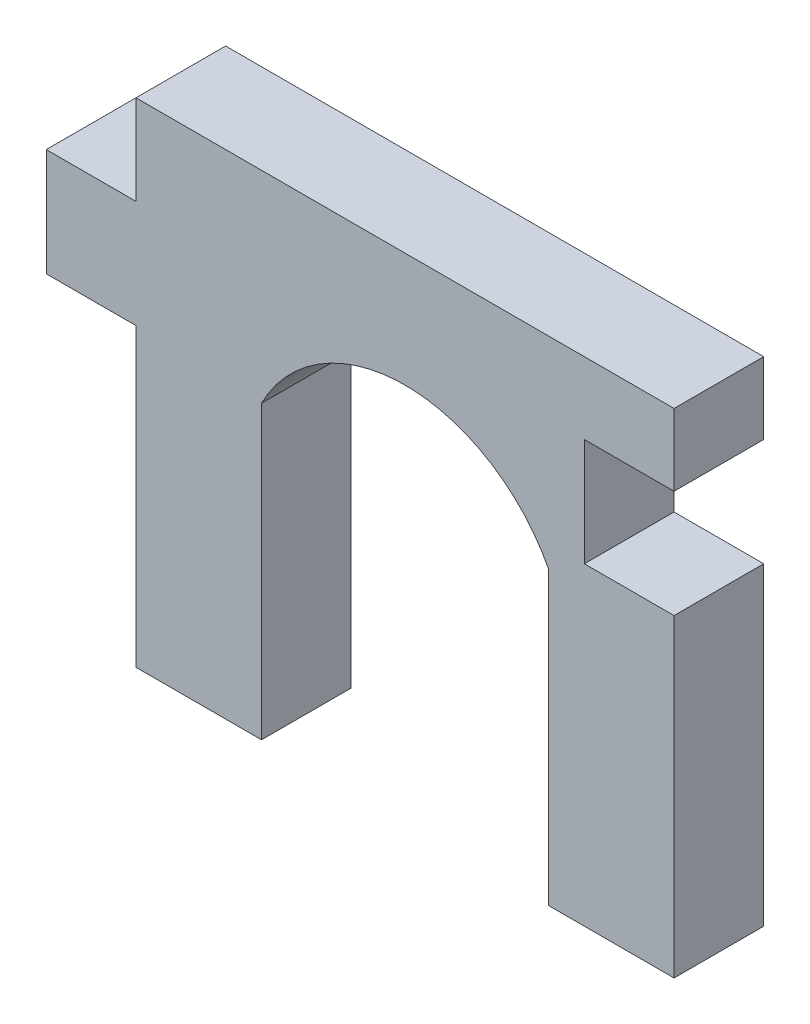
ISO-10303-21;
HEADER;
FILE_DESCRIPTION(('STEP AP214'),'2;1');
FILE_NAME('part.step','',(''),(''),'','','');
FILE_SCHEMA(('AUTOMOTIVE_DESIGN { 1 0 10303 214 1 1 1 1 }'));
ENDSEC;
DATA;
#1=APPLICATION_CONTEXT('core data for automotive mechanical design processes');
#2=APPLICATION_PROTOCOL_DEFINITION('international standard','automotive_design',2000,#1);
#3=PRODUCT_CONTEXT('',#1,'mechanical');
#4=PRODUCT('Part','Part','',(#3));
#5=PRODUCT_RELATED_PRODUCT_CATEGORY('part','',(#4));
#6=PRODUCT_DEFINITION_FORMATION('','',#4);
#7=PRODUCT_DEFINITION_CONTEXT('part definition',#1,'design');
#8=PRODUCT_DEFINITION('design','',#6,#7);
#9=PRODUCT_DEFINITION_SHAPE('','',#8);
#10=(LENGTH_UNIT() NAMED_UNIT(*) SI_UNIT(.MILLI.,.METRE.));
#11=(NAMED_UNIT(*) PLANE_ANGLE_UNIT() SI_UNIT($,.RADIAN.));
#12=(NAMED_UNIT(*) SI_UNIT($,.STERADIAN.) SOLID_ANGLE_UNIT());
#13=UNCERTAINTY_MEASURE_WITH_UNIT(LENGTH_MEASURE(1.E-05),#10,'distance_accuracy_value','');
#14=(GEOMETRIC_REPRESENTATION_CONTEXT(3) GLOBAL_UNCERTAINTY_ASSIGNED_CONTEXT((#13)) GLOBAL_UNIT_ASSIGNED_CONTEXT((#10,
#11,#12)) REPRESENTATION_CONTEXT('',''));
#15=CARTESIAN_POINT('',(0.,0.,0.));
#16=DIRECTION('',(0.,0.,1.));
#17=DIRECTION('',(1.,0.,0.));
#18=AXIS2_PLACEMENT_3D('',#15,#16,#17);
#19=CARTESIAN_POINT('',(0.,0.,6.35));
#20=DIRECTION('',(-1.,0.,0.));
#21=DIRECTION('',(0.,0.,1.));
#22=AXIS2_PLACEMENT_3D('',#19,#20,#21);
#23=PLANE('',#22);
#24=DIRECTION('',(0.,1.,0.));
#25=VECTOR('',#24,1.);
#26=CARTESIAN_POINT('',(0.,0.,0.));
#27=LINE('',#26,#25);
#28=CARTESIAN_POINT('',(0.,-6.35000000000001,0.));
#29=VERTEX_POINT('',#28);
#30=CARTESIAN_POINT('',(0.,15.875,0.));
#31=VERTEX_POINT('',#30);
#32=EDGE_CURVE('E248',#29,#31,#27,.T.);
#33=ORIENTED_EDGE('',*,*,#32,.T.);
#34=DIRECTION('',(0.,0.,1.));
#35=VECTOR('',#34,1.);
#36=CARTESIAN_POINT('',(0.,15.875,-6.35));
#37=LINE('',#36,#35);
#38=CARTESIAN_POINT('',(0.,15.875,6.35));
#39=VERTEX_POINT('',#38);
#40=EDGE_CURVE('E207',#31,#39,#37,.T.);
#41=ORIENTED_EDGE('',*,*,#40,.T.);
#42=DIRECTION('',(0.,1.,0.));
#43=VECTOR('',#42,1.);
#44=CARTESIAN_POINT('',(0.,0.,6.35));
#45=LINE('',#44,#43);
#46=CARTESIAN_POINT('',(0.,-6.35000000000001,6.35));
#47=VERTEX_POINT('',#46);
#48=EDGE_CURVE('E184',#47,#39,#45,.T.);
#49=ORIENTED_EDGE('',*,*,#48,.F.);
#50=DIRECTION('',(0.,0.,-1.));
#51=VECTOR('',#50,1.);
#52=CARTESIAN_POINT('',(0.,-6.35000000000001,6.35));
#53=LINE('',#52,#51);
#54=EDGE_CURVE('E252',#47,#29,#53,.T.);
#55=ORIENTED_EDGE('',*,*,#54,.T.);
#56=EDGE_LOOP('',(#33,#41,#49,#55));
#57=FACE_BOUND('',#56,.T.);
#58=ADVANCED_FACE('F45',(#57),#23,.F.);
#59=CARTESIAN_POINT('',(-29.21,0.,6.35));
#60=DIRECTION('',(-1.,0.,0.));
#61=DIRECTION('',(0.,0.,1.));
#62=AXIS2_PLACEMENT_3D('',#59,#60,#61);
#63=PLANE('',#62);
#64=DIRECTION('',(0.,1.,0.));
#65=VECTOR('',#64,1.);
#66=CARTESIAN_POINT('',(-29.21,0.,0.));
#67=LINE('',#66,#65);
#68=CARTESIAN_POINT('',(-29.21,-6.35000000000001,0.));
#69=VERTEX_POINT('',#68);
#70=CARTESIAN_POINT('',(-29.21,14.29004,0.));
#71=VERTEX_POINT('',#70);
#72=EDGE_CURVE('E210',#69,#71,#67,.T.);
#73=ORIENTED_EDGE('',*,*,#72,.T.);
#74=DIRECTION('',(0.,0.,-1.));
#75=VECTOR('',#74,1.);
#76=CARTESIAN_POINT('',(-29.21,14.29004,6.35));
#77=LINE('',#76,#75);
#78=CARTESIAN_POINT('',(-29.21,14.29004,6.35));
#79=VERTEX_POINT('',#78);
#80=EDGE_CURVE('E291',#79,#71,#77,.T.);
#81=ORIENTED_EDGE('',*,*,#80,.F.);
#82=DIRECTION('',(0.,1.,0.));
#83=VECTOR('',#82,1.);
#84=CARTESIAN_POINT('',(-29.21,0.,6.35));
#85=LINE('',#84,#83);
#86=CARTESIAN_POINT('',(-29.21,-6.35000000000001,6.35));
#87=VERTEX_POINT('',#86);
#88=EDGE_CURVE('E197',#87,#79,#85,.T.);
#89=ORIENTED_EDGE('',*,*,#88,.F.);
#90=DIRECTION('',(0.,0.,-1.));
#91=VECTOR('',#90,1.);
#92=CARTESIAN_POINT('',(-29.21,-6.35000000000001,6.35));
#93=LINE('',#92,#91);
#94=EDGE_CURVE('E175',#87,#69,#93,.T.);
#95=ORIENTED_EDGE('',*,*,#94,.T.);
#96=EDGE_LOOP('',(#73,#81,#89,#95));
#97=FACE_BOUND('',#96,.T.);
#98=ADVANCED_FACE('F47',(#97),#63,.F.);
#99=CARTESIAN_POINT('',(-19.05,9.05369585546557,6.35));
#100=DIRECTION('',(0.,0.,-1.));
#101=DIRECTION('',(-1.,0.,0.));
#102=AXIS2_PLACEMENT_3D('',#99,#100,#101);
#103=CYLINDRICAL_SURFACE('',#102,11.43);
#104=CARTESIAN_POINT('',(-19.05,9.05369585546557,0.));
#105=DIRECTION('',(0.,0.,1.));
#106=DIRECTION('',(1.,0.,0.));
#107=AXIS2_PLACEMENT_3D('',#104,#105,#106);
#108=CIRCLE('',#107,11.43);
#109=CARTESIAN_POINT('',(-8.89,14.29004,0.));
#110=VERTEX_POINT('',#109);
#111=EDGE_CURVE('E315',#71,#110,#108,.F.);
#112=ORIENTED_EDGE('',*,*,#111,.T.);
#113=DIRECTION('',(0.,0.,-1.));
#114=VECTOR('',#113,1.);
#115=CARTESIAN_POINT('',(-8.89,14.29004,6.35));
#116=LINE('',#115,#114);
#117=CARTESIAN_POINT('',(-8.89,14.29004,6.35));
#118=VERTEX_POINT('',#117);
#119=EDGE_CURVE('E289',#118,#110,#116,.T.);
#120=ORIENTED_EDGE('',*,*,#119,.F.);
#121=CARTESIAN_POINT('',(-19.05,9.05369585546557,6.35));
#122=DIRECTION('',(0.,0.,1.));
#123=DIRECTION('',(1.,0.,0.));
#124=AXIS2_PLACEMENT_3D('',#121,#122,#123);
#125=CIRCLE('',#124,11.43);
#126=EDGE_CURVE('E123',#79,#118,#125,.F.);
#127=ORIENTED_EDGE('',*,*,#126,.F.);
#128=ORIENTED_EDGE('',*,*,#80,.T.);
#129=EDGE_LOOP('',(#112,#120,#127,#128));
#130=FACE_BOUND('',#129,.T.);
#131=ADVANCED_FACE('F326',(#130),#103,.F.);
#132=CARTESIAN_POINT('',(-8.89,0.,6.35));
#133=DIRECTION('',(-1.,0.,0.));
#134=DIRECTION('',(0.,0.,1.));
#135=AXIS2_PLACEMENT_3D('',#132,#133,#134);
#136=PLANE('',#135);
#137=DIRECTION('',(0.,1.,0.));
#138=VECTOR('',#137,1.);
#139=CARTESIAN_POINT('',(-8.89,0.,0.));
#140=LINE('',#139,#138);
#141=CARTESIAN_POINT('',(-8.89,-6.35000000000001,0.));
#142=VERTEX_POINT('',#141);
#143=EDGE_CURVE('E317',#142,#110,#140,.T.);
#144=ORIENTED_EDGE('',*,*,#143,.F.);
#145=DIRECTION('',(0.,0.,-1.));
#146=VECTOR('',#145,1.);
#147=CARTESIAN_POINT('',(-8.89,-6.35000000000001,6.35));
#148=LINE('',#147,#146);
#149=CARTESIAN_POINT('',(-8.89,-6.35000000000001,6.35));
#150=VERTEX_POINT('',#149);
#151=EDGE_CURVE('E287',#150,#142,#148,.T.);
#152=ORIENTED_EDGE('',*,*,#151,.F.);
#153=DIRECTION('',(0.,1.,0.));
#154=VECTOR('',#153,1.);
#155=CARTESIAN_POINT('',(-8.89,0.,6.35));
#156=LINE('',#155,#154);
#157=EDGE_CURVE('E193',#150,#118,#156,.T.);
#158=ORIENTED_EDGE('',*,*,#157,.T.);
#159=ORIENTED_EDGE('',*,*,#119,.T.);
#160=EDGE_LOOP('',(#144,#152,#158,#159));
#161=FACE_BOUND('',#160,.T.);
#162=ADVANCED_FACE('F324',(#161),#136,.T.);
#163=CARTESIAN_POINT('',(0.,-6.35000000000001,6.35));
#164=DIRECTION('',(0.,1.,0.));
#165=DIRECTION('',(0.,0.,1.));
#166=AXIS2_PLACEMENT_3D('',#163,#164,#165);
#167=PLANE('',#166);
#168=DIRECTION('',(1.,0.,0.));
#169=VECTOR('',#168,1.);
#170=CARTESIAN_POINT('',(0.,-6.35000000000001,0.));
#171=LINE('',#170,#169);
#172=EDGE_CURVE('E259',#142,#29,#171,.T.);
#173=ORIENTED_EDGE('',*,*,#172,.T.);
#174=ORIENTED_EDGE('',*,*,#54,.F.);
#175=DIRECTION('',(1.,0.,0.));
#176=VECTOR('',#175,1.);
#177=CARTESIAN_POINT('',(0.,-6.35000000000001,6.35));
#178=LINE('',#177,#176);
#179=EDGE_CURVE('E191',#150,#47,#178,.T.);
#180=ORIENTED_EDGE('',*,*,#179,.F.);
#181=ORIENTED_EDGE('',*,*,#151,.T.);
#182=EDGE_LOOP('',(#173,#174,#180,#181));
#183=FACE_BOUND('',#182,.T.);
#184=ADVANCED_FACE('F321',(#183),#167,.F.);
#185=CARTESIAN_POINT('',(0.,23.495,6.35));
#186=VERTEX_POINT('',#185);
#187=CARTESIAN_POINT('',(0.,28.575,6.35));
#188=VERTEX_POINT('',#187);
#189=EDGE_CURVE('E188',#186,#188,#45,.T.);
#190=ORIENTED_EDGE('',*,*,#189,.F.);
#191=DIRECTION('',(0.,0.,1.));
#192=VECTOR('',#191,1.);
#193=CARTESIAN_POINT('',(0.,23.495,-6.35));
#194=LINE('',#193,#192);
#195=CARTESIAN_POINT('',(0.,23.495,0.));
#196=VERTEX_POINT('',#195);
#197=EDGE_CURVE('E199',#196,#186,#194,.T.);
#198=ORIENTED_EDGE('',*,*,#197,.F.);
#199=CARTESIAN_POINT('',(0.,28.575,0.));
#200=VERTEX_POINT('',#199);
#201=EDGE_CURVE('E254',#196,#200,#27,.T.);
#202=ORIENTED_EDGE('',*,*,#201,.T.);
#203=DIRECTION('',(0.,0.,-1.));
#204=VECTOR('',#203,1.);
#205=CARTESIAN_POINT('',(0.,28.575,6.35));
#206=LINE('',#205,#204);
#207=EDGE_CURVE('E283',#188,#200,#206,.T.);
#208=ORIENTED_EDGE('',*,*,#207,.F.);
#209=EDGE_LOOP('',(#190,#198,#202,#208));
#210=FACE_BOUND('',#209,.T.);
#211=ADVANCED_FACE('F297',(#210),#23,.F.);
#212=CARTESIAN_POINT('',(0.,28.575,6.35));
#213=DIRECTION('',(0.,-1.,0.));
#214=DIRECTION('',(1.,0.,0.));
#215=AXIS2_PLACEMENT_3D('',#212,#213,#214);
#216=PLANE('',#215);
#217=DIRECTION('',(-1.,0.,0.));
#218=VECTOR('',#217,1.);
#219=CARTESIAN_POINT('',(0.,28.575,0.));
#220=LINE('',#219,#218);
#221=CARTESIAN_POINT('',(-38.1,28.575,0.));
#222=VERTEX_POINT('',#221);
#223=EDGE_CURVE('E253',#200,#222,#220,.T.);
#224=ORIENTED_EDGE('',*,*,#223,.T.);
#225=DIRECTION('',(0.,0.,-1.));
#226=VECTOR('',#225,1.);
#227=CARTESIAN_POINT('',(-38.1,28.575,6.35));
#228=LINE('',#227,#226);
#229=CARTESIAN_POINT('',(-38.1,28.575,6.35));
#230=VERTEX_POINT('',#229);
#231=EDGE_CURVE('E281',#230,#222,#228,.T.);
#232=ORIENTED_EDGE('',*,*,#231,.F.);
#233=DIRECTION('',(-1.,0.,0.));
#234=VECTOR('',#233,1.);
#235=CARTESIAN_POINT('',(0.,28.575,6.35));
#236=LINE('',#235,#234);
#237=EDGE_CURVE('E181',#188,#230,#236,.T.);
#238=ORIENTED_EDGE('',*,*,#237,.F.);
#239=ORIENTED_EDGE('',*,*,#207,.T.);
#240=EDGE_LOOP('',(#224,#232,#238,#239));
#241=FACE_BOUND('',#240,.T.);
#242=ADVANCED_FACE('F300',(#241),#216,.F.);
#243=CARTESIAN_POINT('',(-38.1,0.,6.35));
#244=DIRECTION('',(-1.,0.,0.));
#245=DIRECTION('',(0.,0.,1.));
#246=AXIS2_PLACEMENT_3D('',#243,#244,#245);
#247=PLANE('',#246);
#248=DIRECTION('',(0.,1.,0.));
#249=VECTOR('',#248,1.);
#250=CARTESIAN_POINT('',(-38.1,0.,0.));
#251=LINE('',#250,#249);
#252=CARTESIAN_POINT('',(-38.1,22.225,0.));
#253=VERTEX_POINT('',#252);
#254=EDGE_CURVE('E257',#253,#222,#251,.T.);
#255=ORIENTED_EDGE('',*,*,#254,.F.);
#256=DIRECTION('',(0.,0.,-1.));
#257=VECTOR('',#256,1.);
#258=CARTESIAN_POINT('',(-38.1,22.225,6.35));
#259=LINE('',#258,#257);
#260=CARTESIAN_POINT('',(-38.1,22.225,6.35));
#261=VERTEX_POINT('',#260);
#262=EDGE_CURVE('E279',#261,#253,#259,.T.);
#263=ORIENTED_EDGE('',*,*,#262,.F.);
#264=DIRECTION('',(0.,1.,0.));
#265=VECTOR('',#264,1.);
#266=CARTESIAN_POINT('',(-38.1,0.,6.35));
#267=LINE('',#266,#265);
#268=EDGE_CURVE('E174',#261,#230,#267,.T.);
#269=ORIENTED_EDGE('',*,*,#268,.T.);
#270=ORIENTED_EDGE('',*,*,#231,.T.);
#271=EDGE_LOOP('',(#255,#263,#269,#270));
#272=FACE_BOUND('',#271,.T.);
#273=ADVANCED_FACE('F302',(#272),#247,.T.);
#274=CARTESIAN_POINT('',(0.,22.225,6.35));
#275=DIRECTION('',(0.,-1.,0.));
#276=DIRECTION('',(1.,0.,0.));
#277=AXIS2_PLACEMENT_3D('',#274,#275,#276);
#278=PLANE('',#277);
#279=DIRECTION('',(-1.,0.,0.));
#280=VECTOR('',#279,1.);
#281=CARTESIAN_POINT('',(0.,22.225,0.));
#282=LINE('',#281,#280);
#283=CARTESIAN_POINT('',(-44.45,22.225,0.));
#284=VERTEX_POINT('',#283);
#285=EDGE_CURVE('E265',#253,#284,#282,.T.);
#286=ORIENTED_EDGE('',*,*,#285,.T.);
#287=DIRECTION('',(0.,0.,-1.));
#288=VECTOR('',#287,1.);
#289=CARTESIAN_POINT('',(-44.45,22.225,6.35));
#290=LINE('',#289,#288);
#291=CARTESIAN_POINT('',(-44.45,22.225,6.35));
#292=VERTEX_POINT('',#291);
#293=EDGE_CURVE('E276',#292,#284,#290,.T.);
#294=ORIENTED_EDGE('',*,*,#293,.F.);
#295=DIRECTION('',(-1.,0.,0.));
#296=VECTOR('',#295,1.);
#297=CARTESIAN_POINT('',(0.,22.225,6.35));
#298=LINE('',#297,#296);
#299=EDGE_CURVE('E180',#261,#292,#298,.T.);
#300=ORIENTED_EDGE('',*,*,#299,.F.);
#301=ORIENTED_EDGE('',*,*,#262,.T.);
#302=EDGE_LOOP('',(#286,#294,#300,#301));
#303=FACE_BOUND('',#302,.T.);
#304=ADVANCED_FACE('F308',(#303),#278,.F.);
#305=CARTESIAN_POINT('',(-44.45,0.,6.35));
#306=DIRECTION('',(1.,0.,0.));
#307=DIRECTION('',(0.,0.,-1.));
#308=AXIS2_PLACEMENT_3D('',#305,#306,#307);
#309=PLANE('',#308);
#310=DIRECTION('',(0.,-1.,0.));
#311=VECTOR('',#310,1.);
#312=CARTESIAN_POINT('',(-44.45,0.,0.));
#313=LINE('',#312,#311);
#314=CARTESIAN_POINT('',(-44.45,14.605,0.));
#315=VERTEX_POINT('',#314);
#316=EDGE_CURVE('E268',#284,#315,#313,.T.);
#317=ORIENTED_EDGE('',*,*,#316,.T.);
#318=DIRECTION('',(0.,0.,-1.));
#319=VECTOR('',#318,1.);
#320=CARTESIAN_POINT('',(-44.45,14.605,6.35));
#321=LINE('',#320,#319);
#322=CARTESIAN_POINT('',(-44.45,14.605,6.35));
#323=VERTEX_POINT('',#322);
#324=EDGE_CURVE('E162',#323,#315,#321,.T.);
#325=ORIENTED_EDGE('',*,*,#324,.F.);
#326=DIRECTION('',(0.,-1.,0.));
#327=VECTOR('',#326,1.);
#328=CARTESIAN_POINT('',(-44.45,0.,6.35));
#329=LINE('',#328,#327);
#330=EDGE_CURVE('E169',#292,#323,#329,.T.);
#331=ORIENTED_EDGE('',*,*,#330,.F.);
#332=ORIENTED_EDGE('',*,*,#293,.T.);
#333=EDGE_LOOP('',(#317,#325,#331,#332));
#334=FACE_BOUND('',#333,.T.);
#335=ADVANCED_FACE('F310',(#334),#309,.F.);
#336=CARTESIAN_POINT('',(0.,14.605,6.35));
#337=DIRECTION('',(0.,-1.,0.));
#338=DIRECTION('',(1.,0.,0.));
#339=AXIS2_PLACEMENT_3D('',#336,#337,#338);
#340=PLANE('',#339);
#341=DIRECTION('',(-1.,0.,0.));
#342=VECTOR('',#341,1.);
#343=CARTESIAN_POINT('',(0.,14.605,0.));
#344=LINE('',#343,#342);
#345=CARTESIAN_POINT('',(-38.1,14.605,0.));
#346=VERTEX_POINT('',#345);
#347=EDGE_CURVE('E157',#346,#315,#344,.T.);
#348=ORIENTED_EDGE('',*,*,#347,.F.);
#349=DIRECTION('',(0.,0.,-1.));
#350=VECTOR('',#349,1.);
#351=CARTESIAN_POINT('',(-38.1,14.605,6.35));
#352=LINE('',#351,#350);
#353=CARTESIAN_POINT('',(-38.1,14.605,6.35));
#354=VERTEX_POINT('',#353);
#355=EDGE_CURVE('E152',#354,#346,#352,.T.);
#356=ORIENTED_EDGE('',*,*,#355,.F.);
#357=DIRECTION('',(-1.,0.,0.));
#358=VECTOR('',#357,1.);
#359=CARTESIAN_POINT('',(0.,14.605,6.35));
#360=LINE('',#359,#358);
#361=EDGE_CURVE('E155',#354,#323,#360,.T.);
#362=ORIENTED_EDGE('',*,*,#361,.T.);
#363=ORIENTED_EDGE('',*,*,#324,.T.);
#364=EDGE_LOOP('',(#348,#356,#362,#363));
#365=FACE_BOUND('',#364,.T.);
#366=ADVANCED_FACE('F154',(#365),#340,.T.);
#367=CARTESIAN_POINT('',(-38.1,-6.35000000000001,0.));
#368=VERTEX_POINT('',#367);
#369=EDGE_CURVE('E266',#368,#346,#251,.T.);
#370=ORIENTED_EDGE('',*,*,#369,.F.);
#371=DIRECTION('',(0.,0.,-1.));
#372=VECTOR('',#371,1.);
#373=CARTESIAN_POINT('',(-38.1,-6.35000000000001,6.35));
#374=LINE('',#373,#372);
#375=CARTESIAN_POINT('',(-38.1,-6.35000000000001,6.35));
#376=VERTEX_POINT('',#375);
#377=EDGE_CURVE('E163',#376,#368,#374,.T.);
#378=ORIENTED_EDGE('',*,*,#377,.F.);
#379=EDGE_CURVE('E167',#376,#354,#267,.T.);
#380=ORIENTED_EDGE('',*,*,#379,.T.);
#381=ORIENTED_EDGE('',*,*,#355,.T.);
#382=EDGE_LOOP('',(#370,#378,#380,#381));
#383=FACE_BOUND('',#382,.T.);
#384=ADVANCED_FACE('F172',(#383),#247,.T.);
#385=CARTESIAN_POINT('',(0.,-6.35000000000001,6.35));
#386=DIRECTION('',(0.,1.,0.));
#387=DIRECTION('',(0.,0.,1.));
#388=AXIS2_PLACEMENT_3D('',#385,#386,#387);
#389=PLANE('',#388);
#390=DIRECTION('',(1.,0.,0.));
#391=VECTOR('',#390,1.);
#392=CARTESIAN_POINT('',(0.,-6.35000000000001,0.));
#393=LINE('',#392,#391);
#394=EDGE_CURVE('E114',#368,#69,#393,.T.);
#395=ORIENTED_EDGE('',*,*,#394,.T.);
#396=ORIENTED_EDGE('',*,*,#94,.F.);
#397=DIRECTION('',(1.,0.,0.));
#398=VECTOR('',#397,1.);
#399=CARTESIAN_POINT('',(0.,-6.35000000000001,6.35));
#400=LINE('',#399,#398);
#401=EDGE_CURVE('E69',#376,#87,#400,.T.);
#402=ORIENTED_EDGE('',*,*,#401,.F.);
#403=ORIENTED_EDGE('',*,*,#377,.T.);
#404=EDGE_LOOP('',(#395,#396,#402,#403));
#405=FACE_BOUND('',#404,.T.);
#406=ADVANCED_FACE('F331',(#405),#389,.F.);
#407=CARTESIAN_POINT('',(0.,0.,6.35));
#408=DIRECTION('',(0.,0.,1.));
#409=DIRECTION('',(1.,0.,0.));
#410=AXIS2_PLACEMENT_3D('',#407,#408,#409);
#411=PLANE('',#410);
#412=DIRECTION('',(1.,0.,0.));
#413=VECTOR('',#412,1.);
#414=CARTESIAN_POINT('',(0.,15.875,6.35));
#415=LINE('',#414,#413);
#416=CARTESIAN_POINT('',(-6.35,15.875,6.35));
#417=VERTEX_POINT('',#416);
#418=EDGE_CURVE('E202',#417,#39,#415,.T.);
#419=ORIENTED_EDGE('',*,*,#418,.F.);
#420=DIRECTION('',(0.,-1.,0.));
#421=VECTOR('',#420,1.);
#422=CARTESIAN_POINT('',(-6.35,23.495,6.35));
#423=LINE('',#422,#421);
#424=CARTESIAN_POINT('',(-6.35,23.495,6.35));
#425=VERTEX_POINT('',#424);
#426=EDGE_CURVE('E213',#425,#417,#423,.T.);
#427=ORIENTED_EDGE('',*,*,#426,.F.);
#428=DIRECTION('',(-1.,0.,0.));
#429=VECTOR('',#428,1.);
#430=CARTESIAN_POINT('',(0.,23.495,6.35));
#431=LINE('',#430,#429);
#432=EDGE_CURVE('E216',#186,#425,#431,.T.);
#433=ORIENTED_EDGE('',*,*,#432,.F.);
#434=ORIENTED_EDGE('',*,*,#189,.T.);
#435=ORIENTED_EDGE('',*,*,#237,.T.);
#436=ORIENTED_EDGE('',*,*,#268,.F.);
#437=ORIENTED_EDGE('',*,*,#299,.T.);
#438=ORIENTED_EDGE('',*,*,#330,.T.);
#439=ORIENTED_EDGE('',*,*,#361,.F.);
#440=ORIENTED_EDGE('',*,*,#379,.F.);
#441=ORIENTED_EDGE('',*,*,#401,.T.);
#442=ORIENTED_EDGE('',*,*,#88,.T.);
#443=ORIENTED_EDGE('',*,*,#126,.T.);
#444=ORIENTED_EDGE('',*,*,#157,.F.);
#445=ORIENTED_EDGE('',*,*,#179,.T.);
#446=ORIENTED_EDGE('',*,*,#48,.T.);
#447=EDGE_LOOP('',(#419,#427,#433,#434,#435,#436,#437,#438,#439,#440,#441,#442,#443,#444,#445,#446));
#448=FACE_BOUND('',#447,.T.);
#449=ADVANCED_FACE('F166',(#448),#411,.T.);
#450=CARTESIAN_POINT('',(0.,0.,0.));
#451=DIRECTION('',(0.,0.,1.));
#452=DIRECTION('',(1.,0.,0.));
#453=AXIS2_PLACEMENT_3D('',#450,#451,#452);
#454=PLANE('',#453);
#455=DIRECTION('',(0.,-1.,0.));
#456=VECTOR('',#455,1.);
#457=CARTESIAN_POINT('',(-6.34999999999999,0.,0.));
#458=LINE('',#457,#456);
#459=CARTESIAN_POINT('',(-6.35,23.495,0.));
#460=VERTEX_POINT('',#459);
#461=CARTESIAN_POINT('',(-6.35,15.875,0.));
#462=VERTEX_POINT('',#461);
#463=EDGE_CURVE('E53',#460,#462,#458,.T.);
#464=ORIENTED_EDGE('',*,*,#463,.T.);
#465=DIRECTION('',(1.,0.,0.));
#466=VECTOR('',#465,1.);
#467=CARTESIAN_POINT('',(0.,15.875,0.));
#468=LINE('',#467,#466);
#469=EDGE_CURVE('E11',#462,#31,#468,.T.);
#470=ORIENTED_EDGE('',*,*,#469,.T.);
#471=ORIENTED_EDGE('',*,*,#32,.F.);
#472=ORIENTED_EDGE('',*,*,#172,.F.);
#473=ORIENTED_EDGE('',*,*,#143,.T.);
#474=ORIENTED_EDGE('',*,*,#111,.F.);
#475=ORIENTED_EDGE('',*,*,#72,.F.);
#476=ORIENTED_EDGE('',*,*,#394,.F.);
#477=ORIENTED_EDGE('',*,*,#369,.T.);
#478=ORIENTED_EDGE('',*,*,#347,.T.);
#479=ORIENTED_EDGE('',*,*,#316,.F.);
#480=ORIENTED_EDGE('',*,*,#285,.F.);
#481=ORIENTED_EDGE('',*,*,#254,.T.);
#482=ORIENTED_EDGE('',*,*,#223,.F.);
#483=ORIENTED_EDGE('',*,*,#201,.F.);
#484=DIRECTION('',(-1.,0.,0.));
#485=VECTOR('',#484,1.);
#486=CARTESIAN_POINT('',(0.,23.495,0.));
#487=LINE('',#486,#485);
#488=EDGE_CURVE('E293',#196,#460,#487,.T.);
#489=ORIENTED_EDGE('',*,*,#488,.T.);
#490=EDGE_LOOP('',(#464,#470,#471,#472,#473,#474,#475,#476,#477,#478,#479,#480,#481,#482,#483,#489));
#491=FACE_BOUND('',#490,.T.);
#492=ADVANCED_FACE('F246',(#491),#454,.F.);
#493=CARTESIAN_POINT('',(0.,15.875,-6.35));
#494=DIRECTION('',(0.,-1.,0.));
#495=DIRECTION('',(0.,0.,-1.));
#496=AXIS2_PLACEMENT_3D('',#493,#494,#495);
#497=PLANE('',#496);
#498=DIRECTION('',(0.,0.,1.));
#499=VECTOR('',#498,1.);
#500=CARTESIAN_POINT('',(-6.35,15.875,-6.35));
#501=LINE('',#500,#499);
#502=EDGE_CURVE('E204',#462,#417,#501,.T.);
#503=ORIENTED_EDGE('',*,*,#502,.T.);
#504=ORIENTED_EDGE('',*,*,#418,.T.);
#505=ORIENTED_EDGE('',*,*,#40,.F.);
#506=ORIENTED_EDGE('',*,*,#469,.F.);
#507=EDGE_LOOP('',(#503,#504,#505,#506));
#508=FACE_BOUND('',#507,.T.);
#509=ADVANCED_FACE('F240',(#508),#497,.F.);
#510=CARTESIAN_POINT('',(-6.35,23.495,-6.35));
#511=DIRECTION('',(-1.,0.,0.));
#512=DIRECTION('',(0.,-1.,0.));
#513=AXIS2_PLACEMENT_3D('',#510,#511,#512);
#514=PLANE('',#513);
#515=DIRECTION('',(0.,0.,1.));
#516=VECTOR('',#515,1.);
#517=CARTESIAN_POINT('',(-6.35,23.495,-6.35));
#518=LINE('',#517,#516);
#519=EDGE_CURVE('E60',#460,#425,#518,.T.);
#520=ORIENTED_EDGE('',*,*,#519,.T.);
#521=ORIENTED_EDGE('',*,*,#426,.T.);
#522=ORIENTED_EDGE('',*,*,#502,.F.);
#523=ORIENTED_EDGE('',*,*,#463,.F.);
#524=EDGE_LOOP('',(#520,#521,#522,#523));
#525=FACE_BOUND('',#524,.T.);
#526=ADVANCED_FACE('F228',(#525),#514,.F.);
#527=CARTESIAN_POINT('',(0.,23.495,-6.35));
#528=DIRECTION('',(0.,1.,0.));
#529=DIRECTION('',(-1.,0.,0.));
#530=AXIS2_PLACEMENT_3D('',#527,#528,#529);
#531=PLANE('',#530);
#532=ORIENTED_EDGE('',*,*,#197,.T.);
#533=ORIENTED_EDGE('',*,*,#432,.T.);
#534=ORIENTED_EDGE('',*,*,#519,.F.);
#535=ORIENTED_EDGE('',*,*,#488,.F.);
#536=EDGE_LOOP('',(#532,#533,#534,#535));
#537=FACE_BOUND('',#536,.T.);
#538=ADVANCED_FACE('F220',(#537),#531,.F.);
#539=CLOSED_SHELL('',(#58,#98,#131,#162,#184,#211,#242,#273,#304,#335,#366,#384,#406,#449,#492,
#509,#526,#538));
#540=MANIFOLD_SOLID_BREP('B2',#539);
#541=ADVANCED_BREP_SHAPE_REPRESENTATION('',(#18,#540),#14);
#542=SHAPE_DEFINITION_REPRESENTATION(#9,#541);
ENDSEC;
END-ISO-10303-21;
